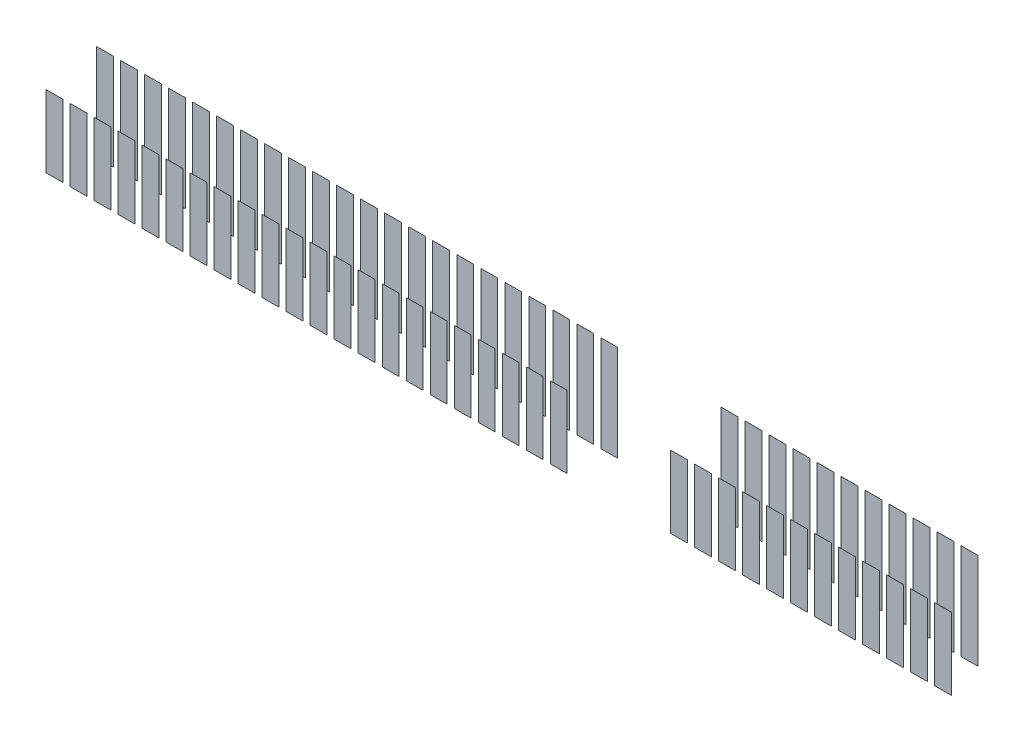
from build123d import *

# Parameters (mm, degrees)
TOP_W                         = 0.35
TOP_H                         = 1.5
BOSS_EXTRUDE1_TOP_DEPTH       = 0.001
BOSS_EXTRUDE1_TOP_2_DEPTH     = 0.001
BOSS_EXTRUDE1_TOP_3_DEPTH     = 0.001
BOSS_EXTRUDE1_TOP_4_DEPTH     = 0.001
BOSS_EXTRUDE1_TOP_5_DEPTH     = 0.001
BOSS_EXTRUDE1_TOP_6_DEPTH     = 0.001
BOSS_EXTRUDE1_TOP_7_DEPTH     = 0.001
BOSS_EXTRUDE1_TOP_8_DEPTH     = 0.001
BOSS_EXTRUDE1_TOP_9_DEPTH     = 0.001
BOSS_EXTRUDE1_TOP_10_DEPTH    = 0.001
BOSS_EXTRUDE1_TOP_11_DEPTH    = 0.001
BOSS_EXTRUDE1_TOP_12_DEPTH    = 0.001
BOSS_EXTRUDE1_TOP_13_DEPTH    = 0.001
BOSS_EXTRUDE1_TOP_14_DEPTH    = 0.001
BOSS_EXTRUDE1_TOP_15_DEPTH    = 0.001
BOSS_EXTRUDE1_TOP_16_DEPTH    = 0.001
BOSS_EXTRUDE1_TOP_17_DEPTH    = 0.001
BOSS_EXTRUDE1_TOP_18_DEPTH    = 0.001
BOSS_EXTRUDE1_TOP_19_DEPTH    = 0.001
BOSS_EXTRUDE1_TOP_20_DEPTH    = 0.001
BOSS_EXTRUDE1_TOP_21_DEPTH    = 0.001
BOSS_EXTRUDE1_TOP_22_DEPTH    = 0.001
BOSS_EXTRUDE1_TOP_23_DEPTH    = 0.001
BOSS_EXTRUDE1_TOP_24_DEPTH    = 0.001
BOSS_EXTRUDE1_TOP_25_DEPTH    = 0.001
BOSS_EXTRUDE1_TOP_26_DEPTH    = 0.001
BOSS_EXTRUDE1_TOP_27_DEPTH    = 0.001
BOSS_EXTRUDE1_TOP_28_DEPTH    = 0.001
BOSS_EXTRUDE1_TOP_29_DEPTH    = 0.001
BOSS_EXTRUDE1_TOP_30_DEPTH    = 0.001
BOSS_EXTRUDE1_TOP_31_DEPTH    = 0.001
BOSS_EXTRUDE1_TOP_32_DEPTH    = 0.001
BOSS_EXTRUDE1_TOP_33_DEPTH    = 0.001
BOSS_EXTRUDE1_TOP_34_DEPTH    = 0.001
BOSS_EXTRUDE2_BOTTOM_START    = -0.8
BOTTOM_W                      = 0.35
BOTTOM_H                      = 2
BOSS_EXTRUDE2_BOTTOM_DEPTH    = 0.001
BOSS_EXTRUDE2_BOTTOM_2_DEPTH  = 0.001
BOSS_EXTRUDE2_BOTTOM_3_DEPTH  = 0.001
BOSS_EXTRUDE2_BOTTOM_4_DEPTH  = 0.001
BOSS_EXTRUDE2_BOTTOM_5_DEPTH  = 0.001
BOSS_EXTRUDE2_BOTTOM_6_DEPTH  = 0.001
BOSS_EXTRUDE2_BOTTOM_7_DEPTH  = 0.001
BOSS_EXTRUDE2_BOTTOM_8_DEPTH  = 0.001
BOSS_EXTRUDE2_BOTTOM_9_DEPTH  = 0.001
BOSS_EXTRUDE2_BOTTOM_10_DEPTH = 0.001
BOSS_EXTRUDE2_BOTTOM_11_DEPTH = 0.001
BOSS_EXTRUDE2_BOTTOM_12_DEPTH = 0.001
BOSS_EXTRUDE2_BOTTOM_13_DEPTH = 0.001
BOSS_EXTRUDE2_BOTTOM_14_DEPTH = 0.001
BOSS_EXTRUDE2_BOTTOM_15_DEPTH = 0.001
BOSS_EXTRUDE2_BOTTOM_16_DEPTH = 0.001
BOSS_EXTRUDE2_BOTTOM_17_DEPTH = 0.001
BOSS_EXTRUDE2_BOTTOM_18_DEPTH = 0.001
BOSS_EXTRUDE2_BOTTOM_19_DEPTH = 0.001
BOSS_EXTRUDE2_BOTTOM_20_DEPTH = 0.001
BOSS_EXTRUDE2_BOTTOM_21_DEPTH = 0.001
BOSS_EXTRUDE2_BOTTOM_22_DEPTH = 0.001
BOSS_EXTRUDE2_BOTTOM_23_DEPTH = 0.001
BOSS_EXTRUDE2_BOTTOM_24_DEPTH = 0.001
BOSS_EXTRUDE2_BOTTOM_25_DEPTH = 0.001
BOSS_EXTRUDE2_BOTTOM_26_DEPTH = 0.001
BOSS_EXTRUDE2_BOTTOM_27_DEPTH = 0.001
BOSS_EXTRUDE2_BOTTOM_28_DEPTH = 0.001
BOSS_EXTRUDE2_BOTTOM_29_DEPTH = 0.001
BOSS_EXTRUDE2_BOTTOM_30_DEPTH = 0.001
BOSS_EXTRUDE2_BOTTOM_31_DEPTH = 0.001
BOSS_EXTRUDE2_BOTTOM_32_DEPTH = 0.001
BOSS_EXTRUDE2_BOTTOM_33_DEPTH = 0.001


with BuildPart() as part:
    # top → Boss-Extrude1-TOP (new body)
    with BuildSketch(Plane.XY):
        with Locations((-9.25, -3.95)):
            Rectangle(TOP_W, TOP_H)
    extrude(amount=BOSS_EXTRUDE1_TOP_DEPTH)


with BuildPart() as body_2:
    # top → Boss-Extrude1-TOP 2 (new body)
    with BuildSketch(Plane.XY):
        with Locations((-8.25, -3.95)):
            Rectangle(TOP_W, TOP_H)
    extrude(amount=BOSS_EXTRUDE1_TOP_2_DEPTH)


with BuildPart() as body_3:
    # top → Boss-Extrude1-TOP 3 (new body)
    with BuildSketch(Plane.XY):
        with Locations((-7.75, -3.95)):
            Rectangle(TOP_W, TOP_H)
    extrude(amount=BOSS_EXTRUDE1_TOP_3_DEPTH)


with BuildPart() as body_4:
    # top → Boss-Extrude1-TOP 4 (new body)
    with BuildSketch(Plane.XY):
        with Locations((-6.75, -3.95)):
            Rectangle(TOP_W, TOP_H)
    extrude(amount=BOSS_EXTRUDE1_TOP_4_DEPTH)


with BuildPart() as body_5:
    # top → Boss-Extrude1-TOP 5 (new body)
    with BuildSketch(Plane.XY):
        with Locations((-5.75, -3.95)):
            Rectangle(TOP_W, TOP_H)
    extrude(amount=BOSS_EXTRUDE1_TOP_5_DEPTH)


with BuildPart() as body_6:
    # top → Boss-Extrude1-TOP 6 (new body)
    with BuildSketch(Plane.XY):
        with Locations((-5.25, -3.95)):
            Rectangle(TOP_W, TOP_H)
    extrude(amount=BOSS_EXTRUDE1_TOP_6_DEPTH)


with BuildPart() as body_7:
    # top → Boss-Extrude1-TOP 7 (new body)
    with BuildSketch(Plane.XY):
        with Locations((-4.75, -3.95)):
            Rectangle(TOP_W, TOP_H)
    extrude(amount=BOSS_EXTRUDE1_TOP_7_DEPTH)


with BuildPart() as body_8:
    # top → Boss-Extrude1-TOP 8 (new body)
    with BuildSketch(Plane.XY):
        with Locations((-4.25, -3.95)):
            Rectangle(TOP_W, TOP_H)
    extrude(amount=BOSS_EXTRUDE1_TOP_8_DEPTH)


with BuildPart() as body_9:
    # top → Boss-Extrude1-TOP 9 (new body)
    with BuildSketch(Plane.XY):
        with Locations((-3.75, -3.95)):
            Rectangle(TOP_W, TOP_H)
    extrude(amount=BOSS_EXTRUDE1_TOP_9_DEPTH)


with BuildPart() as body_10:
    # top → Boss-Extrude1-TOP 10 (new body)
    with BuildSketch(Plane.XY):
        with Locations((-3.25, -3.95)):
            Rectangle(TOP_W, TOP_H)
    extrude(amount=BOSS_EXTRUDE1_TOP_10_DEPTH)


with BuildPart() as body_11:
    # top → Boss-Extrude1-TOP 11 (new body)
    with BuildSketch(Plane.XY):
        with Locations((-2.75, -3.95)):
            Rectangle(TOP_W, TOP_H)
    extrude(amount=BOSS_EXTRUDE1_TOP_11_DEPTH)


with BuildPart() as body_12:
    # top → Boss-Extrude1-TOP 12 (new body)
    with BuildSketch(Plane.XY):
        with Locations((-1.25, -3.95)):
            Rectangle(TOP_W, TOP_H)
    extrude(amount=BOSS_EXTRUDE1_TOP_12_DEPTH)


with BuildPart() as body_13:
    # top → Boss-Extrude1-TOP 13 (new body)
    with BuildSketch(Plane.XY):
        with Locations((-0.75, -3.95)):
            Rectangle(TOP_W, TOP_H)
    extrude(amount=BOSS_EXTRUDE1_TOP_13_DEPTH)


with BuildPart() as body_14:
    # top → Boss-Extrude1-TOP 14 (new body)
    with BuildSketch(Plane.XY):
        with Locations((-0.25, -3.95)):
            Rectangle(TOP_W, TOP_H)
    extrude(amount=BOSS_EXTRUDE1_TOP_14_DEPTH)


with BuildPart() as body_15:
    # top → Boss-Extrude1-TOP 15 (new body)
    with BuildSketch(Plane.XY):
        with Locations((0.25, -3.95)):
            Rectangle(TOP_W, TOP_H)
    extrude(amount=BOSS_EXTRUDE1_TOP_15_DEPTH)


with BuildPart() as body_16:
    # top → Boss-Extrude1-TOP 16 (new body)
    with BuildSketch(Plane.XY):
        with Locations((0.75, -3.95)):
            Rectangle(TOP_W, TOP_H)
    extrude(amount=BOSS_EXTRUDE1_TOP_16_DEPTH)


with BuildPart() as body_17:
    # top → Boss-Extrude1-TOP 17 (new body)
    with BuildSketch(Plane.XY):
        with Locations((3.75, -3.95)):
            Rectangle(TOP_W, TOP_H)
    extrude(amount=BOSS_EXTRUDE1_TOP_17_DEPTH)


with BuildPart() as body_18:
    # top → Boss-Extrude1-TOP 18 (new body)
    with BuildSketch(Plane.XY):
        with Locations((4.25, -3.95)):
            Rectangle(TOP_W, TOP_H)
    extrude(amount=BOSS_EXTRUDE1_TOP_18_DEPTH)


with BuildPart() as body_19:
    # top → Boss-Extrude1-TOP 19 (new body)
    with BuildSketch(Plane.XY):
        with Locations((4.75, -3.95)):
            Rectangle(TOP_W, TOP_H)
    extrude(amount=BOSS_EXTRUDE1_TOP_19_DEPTH)


with BuildPart() as body_20:
    # top → Boss-Extrude1-TOP 20 (new body)
    with BuildSketch(Plane.XY):
        with Locations((5.25, -3.95)):
            Rectangle(TOP_W, TOP_H)
    extrude(amount=BOSS_EXTRUDE1_TOP_20_DEPTH)


with BuildPart() as body_21:
    # top → Boss-Extrude1-TOP 21 (new body)
    with BuildSketch(Plane.XY):
        with Locations((5.75, -3.95)):
            Rectangle(TOP_W, TOP_H)
    extrude(amount=BOSS_EXTRUDE1_TOP_21_DEPTH)


with BuildPart() as body_22:
    # top → Boss-Extrude1-TOP 22 (new body)
    with BuildSketch(Plane.XY):
        with Locations((6.25, -3.95)):
            Rectangle(TOP_W, TOP_H)
    extrude(amount=BOSS_EXTRUDE1_TOP_22_DEPTH)


with BuildPart() as body_23:
    # top → Boss-Extrude1-TOP 23 (new body)
    with BuildSketch(Plane.XY):
        with Locations((6.75, -3.95)):
            Rectangle(TOP_W, TOP_H)
    extrude(amount=BOSS_EXTRUDE1_TOP_23_DEPTH)


with BuildPart() as body_24:
    # top → Boss-Extrude1-TOP 24 (new body)
    with BuildSketch(Plane.XY):
        with Locations((7.25, -3.95)):
            Rectangle(TOP_W, TOP_H)
    extrude(amount=BOSS_EXTRUDE1_TOP_24_DEPTH)


with BuildPart() as body_25:
    # top → Boss-Extrude1-TOP 25 (new body)
    with BuildSketch(Plane.XY):
        with Locations((7.75, -3.95)):
            Rectangle(TOP_W, TOP_H)
    extrude(amount=BOSS_EXTRUDE1_TOP_25_DEPTH)


with BuildPart() as body_26:
    # top → Boss-Extrude1-TOP 26 (new body)
    with BuildSketch(Plane.XY):
        with Locations((8.25, -3.95)):
            Rectangle(TOP_W, TOP_H)
    extrude(amount=BOSS_EXTRUDE1_TOP_26_DEPTH)


with BuildPart() as body_27:
    # top → Boss-Extrude1-TOP 27 (new body)
    with BuildSketch(Plane.XY):
        with Locations((8.75, -3.95)):
            Rectangle(TOP_W, TOP_H)
    extrude(amount=BOSS_EXTRUDE1_TOP_27_DEPTH)


with BuildPart() as body_28:
    # top → Boss-Extrude1-TOP 28 (new body)
    with BuildSketch(Plane.XY):
        with Locations((-8.75, -3.95)):
            Rectangle(TOP_W, TOP_H)
    extrude(amount=BOSS_EXTRUDE1_TOP_28_DEPTH)


with BuildPart() as body_29:
    # top → Boss-Extrude1-TOP 29 (new body)
    with BuildSketch(Plane.XY):
        with Locations((-7.25, -3.95)):
            Rectangle(TOP_W, TOP_H)
    extrude(amount=BOSS_EXTRUDE1_TOP_29_DEPTH)


with BuildPart() as body_30:
    # top → Boss-Extrude1-TOP 30 (new body)
    with BuildSketch(Plane.XY):
        with Locations((-6.25, -3.95)):
            Rectangle(TOP_W, TOP_H)
    extrude(amount=BOSS_EXTRUDE1_TOP_30_DEPTH)


with BuildPart() as body_31:
    # top → Boss-Extrude1-TOP 31 (new body)
    with BuildSketch(Plane.XY):
        with Locations((-2.25, -3.95)):
            Rectangle(TOP_W, TOP_H)
    extrude(amount=BOSS_EXTRUDE1_TOP_31_DEPTH)


with BuildPart() as body_32:
    # top → Boss-Extrude1-TOP 32 (new body)
    with BuildSketch(Plane.XY):
        with Locations((-1.75, -3.95)):
            Rectangle(TOP_W, TOP_H)
    extrude(amount=BOSS_EXTRUDE1_TOP_32_DEPTH)


with BuildPart() as body_33:
    # top → Boss-Extrude1-TOP 33 (new body)
    with BuildSketch(Plane.XY):
        with Locations((1.25, -3.95)):
            Rectangle(TOP_W, TOP_H)
    extrude(amount=BOSS_EXTRUDE1_TOP_33_DEPTH)


with BuildPart() as body_34:
    # top → Boss-Extrude1-TOP 34 (new body)
    with BuildSketch(Plane.XY):
        with Locations((9.25, -3.95)):
            Rectangle(TOP_W, TOP_H)
    extrude(amount=BOSS_EXTRUDE1_TOP_34_DEPTH)


with BuildPart() as body_35:
    # bottom → Boss-Extrude2-BOTTOM (new body)
    with BuildSketch(Plane.XY.offset(BOSS_EXTRUDE2_BOTTOM_START)):
        with Locations((-9, -3.7)):
            Rectangle(BOTTOM_W, BOTTOM_H)
    extrude(amount=-BOSS_EXTRUDE2_BOTTOM_DEPTH)


with BuildPart() as body_36:
    # bottom → Boss-Extrude2-BOTTOM 2 (new body)
    with BuildSketch(Plane.XY.offset(BOSS_EXTRUDE2_BOTTOM_START)):
        with Locations((-8.5, -3.7)):
            Rectangle(BOTTOM_W, BOTTOM_H)
    extrude(amount=-BOSS_EXTRUDE2_BOTTOM_2_DEPTH)


with BuildPart() as body_37:
    # bottom → Boss-Extrude2-BOTTOM 3 (new body)
    with BuildSketch(Plane.XY.offset(BOSS_EXTRUDE2_BOTTOM_START)):
        with Locations((-8, -3.7)):
            Rectangle(BOTTOM_W, BOTTOM_H)
    extrude(amount=-BOSS_EXTRUDE2_BOTTOM_3_DEPTH)


with BuildPart() as body_38:
    # bottom → Boss-Extrude2-BOTTOM 4 (new body)
    with BuildSketch(Plane.XY.offset(BOSS_EXTRUDE2_BOTTOM_START)):
        with Locations((-7.5, -3.7)):
            Rectangle(BOTTOM_W, BOTTOM_H)
    extrude(amount=-BOSS_EXTRUDE2_BOTTOM_4_DEPTH)


with BuildPart() as body_39:
    # bottom → Boss-Extrude2-BOTTOM 5 (new body)
    with BuildSketch(Plane.XY.offset(BOSS_EXTRUDE2_BOTTOM_START)):
        with Locations((-7, -3.7)):
            Rectangle(BOTTOM_W, BOTTOM_H)
    extrude(amount=-BOSS_EXTRUDE2_BOTTOM_5_DEPTH)


with BuildPart() as body_40:
    # bottom → Boss-Extrude2-BOTTOM 6 (new body)
    with BuildSketch(Plane.XY.offset(BOSS_EXTRUDE2_BOTTOM_START)):
        with Locations((-6.5, -3.7)):
            Rectangle(BOTTOM_W, BOTTOM_H)
    extrude(amount=-BOSS_EXTRUDE2_BOTTOM_6_DEPTH)


with BuildPart() as body_41:
    # bottom → Boss-Extrude2-BOTTOM 7 (new body)
    with BuildSketch(Plane.XY.offset(BOSS_EXTRUDE2_BOTTOM_START)):
        with Locations((-6, -3.7)):
            Rectangle(BOTTOM_W, BOTTOM_H)
    extrude(amount=-BOSS_EXTRUDE2_BOTTOM_7_DEPTH)


with BuildPart() as body_42:
    # bottom → Boss-Extrude2-BOTTOM 8 (new body)
    with BuildSketch(Plane.XY.offset(BOSS_EXTRUDE2_BOTTOM_START)):
        with Locations((-5.5, -3.7)):
            Rectangle(BOTTOM_W, BOTTOM_H)
    extrude(amount=-BOSS_EXTRUDE2_BOTTOM_8_DEPTH)


with BuildPart() as body_43:
    # bottom → Boss-Extrude2-BOTTOM 9 (new body)
    with BuildSketch(Plane.XY.offset(BOSS_EXTRUDE2_BOTTOM_START)):
        with Locations((-5, -3.7)):
            Rectangle(BOTTOM_W, BOTTOM_H)
    extrude(amount=-BOSS_EXTRUDE2_BOTTOM_9_DEPTH)


with BuildPart() as body_44:
    # bottom → Boss-Extrude2-BOTTOM 10 (new body)
    with BuildSketch(Plane.XY.offset(BOSS_EXTRUDE2_BOTTOM_START)):
        with Locations((-4.5, -3.7)):
            Rectangle(BOTTOM_W, BOTTOM_H)
    extrude(amount=-BOSS_EXTRUDE2_BOTTOM_10_DEPTH)


with BuildPart() as body_45:
    # bottom → Boss-Extrude2-BOTTOM 11 (new body)
    with BuildSketch(Plane.XY.offset(BOSS_EXTRUDE2_BOTTOM_START)):
        with Locations((-4, -3.7)):
            Rectangle(BOTTOM_W, BOTTOM_H)
    extrude(amount=-BOSS_EXTRUDE2_BOTTOM_11_DEPTH)


with BuildPart() as body_46:
    # bottom → Boss-Extrude2-BOTTOM 12 (new body)
    with BuildSketch(Plane.XY.offset(BOSS_EXTRUDE2_BOTTOM_START)):
        with Locations((-3.5, -3.7)):
            Rectangle(BOTTOM_W, BOTTOM_H)
    extrude(amount=-BOSS_EXTRUDE2_BOTTOM_12_DEPTH)


with BuildPart() as body_47:
    # bottom → Boss-Extrude2-BOTTOM 13 (new body)
    with BuildSketch(Plane.XY.offset(BOSS_EXTRUDE2_BOTTOM_START)):
        with Locations((-3, -3.7)):
            Rectangle(BOTTOM_W, BOTTOM_H)
    extrude(amount=-BOSS_EXTRUDE2_BOTTOM_13_DEPTH)


with BuildPart() as body_48:
    # bottom → Boss-Extrude2-BOTTOM 14 (new body)
    with BuildSketch(Plane.XY.offset(BOSS_EXTRUDE2_BOTTOM_START)):
        with Locations((-2.5, -3.7)):
            Rectangle(BOTTOM_W, BOTTOM_H)
    extrude(amount=-BOSS_EXTRUDE2_BOTTOM_14_DEPTH)


with BuildPart() as body_49:
    # bottom → Boss-Extrude2-BOTTOM 15 (new body)
    with BuildSketch(Plane.XY.offset(BOSS_EXTRUDE2_BOTTOM_START)):
        with Locations((-2, -3.7)):
            Rectangle(BOTTOM_W, BOTTOM_H)
    extrude(amount=-BOSS_EXTRUDE2_BOTTOM_15_DEPTH)


with BuildPart() as body_50:
    # bottom → Boss-Extrude2-BOTTOM 16 (new body)
    with BuildSketch(Plane.XY.offset(BOSS_EXTRUDE2_BOTTOM_START)):
        with Locations((-1.5, -3.7)):
            Rectangle(BOTTOM_W, BOTTOM_H)
    extrude(amount=-BOSS_EXTRUDE2_BOTTOM_16_DEPTH)


with BuildPart() as body_51:
    # bottom → Boss-Extrude2-BOTTOM 17 (new body)
    with BuildSketch(Plane.XY.offset(BOSS_EXTRUDE2_BOTTOM_START)):
        with Locations((-1, -3.7)):
            Rectangle(BOTTOM_W, BOTTOM_H)
    extrude(amount=-BOSS_EXTRUDE2_BOTTOM_17_DEPTH)


with BuildPart() as body_52:
    # bottom → Boss-Extrude2-BOTTOM 18 (new body)
    with BuildSketch(Plane.XY.offset(BOSS_EXTRUDE2_BOTTOM_START)):
        with Locations((-0.5, -3.7)):
            Rectangle(BOTTOM_W, BOTTOM_H)
    extrude(amount=-BOSS_EXTRUDE2_BOTTOM_18_DEPTH)


with BuildPart() as body_53:
    # bottom → Boss-Extrude2-BOTTOM 19 (new body)
    with BuildSketch(Plane.XY.offset(BOSS_EXTRUDE2_BOTTOM_START)):
        with Locations((0, -3.7)):
            Rectangle(BOTTOM_W, BOTTOM_H)
    extrude(amount=-BOSS_EXTRUDE2_BOTTOM_19_DEPTH)


with BuildPart() as body_54:
    # bottom → Boss-Extrude2-BOTTOM 20 (new body)
    with BuildSketch(Plane.XY.offset(BOSS_EXTRUDE2_BOTTOM_START)):
        with Locations((0.5, -3.7)):
            Rectangle(BOTTOM_W, BOTTOM_H)
    extrude(amount=-BOSS_EXTRUDE2_BOTTOM_20_DEPTH)


with BuildPart() as body_55:
    # bottom → Boss-Extrude2-BOTTOM 21 (new body)
    with BuildSketch(Plane.XY.offset(BOSS_EXTRUDE2_BOTTOM_START)):
        with Locations((1, -3.7)):
            Rectangle(BOTTOM_W, BOTTOM_H)
    extrude(amount=-BOSS_EXTRUDE2_BOTTOM_21_DEPTH)


with BuildPart() as body_56:
    # bottom → Boss-Extrude2-BOTTOM 22 (new body)
    with BuildSketch(Plane.XY.offset(BOSS_EXTRUDE2_BOTTOM_START)):
        with Locations((1.5, -3.7)):
            Rectangle(BOTTOM_W, BOTTOM_H)
    extrude(amount=-BOSS_EXTRUDE2_BOTTOM_22_DEPTH)


with BuildPart() as body_57:
    # bottom → Boss-Extrude2-BOTTOM 23 (new body)
    with BuildSketch(Plane.XY.offset(BOSS_EXTRUDE2_BOTTOM_START)):
        with Locations((4, -3.7)):
            Rectangle(BOTTOM_W, BOTTOM_H)
    extrude(amount=-BOSS_EXTRUDE2_BOTTOM_23_DEPTH)


with BuildPart() as body_58:
    # bottom → Boss-Extrude2-BOTTOM 24 (new body)
    with BuildSketch(Plane.XY.offset(BOSS_EXTRUDE2_BOTTOM_START)):
        with Locations((4.5, -3.7)):
            Rectangle(BOTTOM_W, BOTTOM_H)
    extrude(amount=-BOSS_EXTRUDE2_BOTTOM_24_DEPTH)


with BuildPart() as body_59:
    # bottom → Boss-Extrude2-BOTTOM 25 (new body)
    with BuildSketch(Plane.XY.offset(BOSS_EXTRUDE2_BOTTOM_START)):
        with Locations((5, -3.7)):
            Rectangle(BOTTOM_W, BOTTOM_H)
    extrude(amount=-BOSS_EXTRUDE2_BOTTOM_25_DEPTH)


with BuildPart() as body_60:
    # bottom → Boss-Extrude2-BOTTOM 26 (new body)
    with BuildSketch(Plane.XY.offset(BOSS_EXTRUDE2_BOTTOM_START)):
        with Locations((5.5, -3.7)):
            Rectangle(BOTTOM_W, BOTTOM_H)
    extrude(amount=-BOSS_EXTRUDE2_BOTTOM_26_DEPTH)


with BuildPart() as body_61:
    # bottom → Boss-Extrude2-BOTTOM 27 (new body)
    with BuildSketch(Plane.XY.offset(BOSS_EXTRUDE2_BOTTOM_START)):
        with Locations((6, -3.7)):
            Rectangle(BOTTOM_W, BOTTOM_H)
    extrude(amount=-BOSS_EXTRUDE2_BOTTOM_27_DEPTH)


with BuildPart() as body_62:
    # bottom → Boss-Extrude2-BOTTOM 28 (new body)
    with BuildSketch(Plane.XY.offset(BOSS_EXTRUDE2_BOTTOM_START)):
        with Locations((6.5, -3.7)):
            Rectangle(BOTTOM_W, BOTTOM_H)
    extrude(amount=-BOSS_EXTRUDE2_BOTTOM_28_DEPTH)


with BuildPart() as body_63:
    # bottom → Boss-Extrude2-BOTTOM 29 (new body)
    with BuildSketch(Plane.XY.offset(BOSS_EXTRUDE2_BOTTOM_START)):
        with Locations((7, -3.7)):
            Rectangle(BOTTOM_W, BOTTOM_H)
    extrude(amount=-BOSS_EXTRUDE2_BOTTOM_29_DEPTH)


with BuildPart() as body_64:
    # bottom → Boss-Extrude2-BOTTOM 30 (new body)
    with BuildSketch(Plane.XY.offset(BOSS_EXTRUDE2_BOTTOM_START)):
        with Locations((7.5, -3.7)):
            Rectangle(BOTTOM_W, BOTTOM_H)
    extrude(amount=-BOSS_EXTRUDE2_BOTTOM_30_DEPTH)


with BuildPart() as body_65:
    # bottom → Boss-Extrude2-BOTTOM 31 (new body)
    with BuildSketch(Plane.XY.offset(BOSS_EXTRUDE2_BOTTOM_START)):
        with Locations((8, -3.7)):
            Rectangle(BOTTOM_W, BOTTOM_H)
    extrude(amount=-BOSS_EXTRUDE2_BOTTOM_31_DEPTH)


with BuildPart() as body_66:
    # bottom → Boss-Extrude2-BOTTOM 32 (new body)
    with BuildSketch(Plane.XY.offset(BOSS_EXTRUDE2_BOTTOM_START)):
        with Locations((8.5, -3.7)):
            Rectangle(BOTTOM_W, BOTTOM_H)
    extrude(amount=-BOSS_EXTRUDE2_BOTTOM_32_DEPTH)


with BuildPart() as body_67:
    # bottom → Boss-Extrude2-BOTTOM 33 (new body)
    with BuildSketch(Plane.XY.offset(BOSS_EXTRUDE2_BOTTOM_START)):
        with Locations((9, -3.7)):
            Rectangle(BOTTOM_W, BOTTOM_H)
    extrude(amount=-BOSS_EXTRUDE2_BOTTOM_33_DEPTH)


solid = Compound([part.part, body_2.part, body_3.part, body_4.part, body_5.part, body_6.part, body_7.part, body_8.part, body_9.part, body_10.part, body_11.part, body_12.part, body_13.part, body_14.part, body_15.part, body_16.part, body_17.part, body_18.part, body_19.part, body_20.part, body_21.part, body_22.part, body_23.part, body_24.part, body_25.part, body_26.part, body_27.part, body_28.part, body_29.part, body_30.part, body_31.part, body_32.part, body_33.part, body_34.part, body_35.part, body_36.part, body_37.part, body_38.part, body_39.part, body_40.part, body_41.part, body_42.part, body_43.part, body_44.part, body_45.part, body_46.part, body_47.part, body_48.part, body_49.part, body_50.part, body_51.part, body_52.part, body_53.part, body_54.part, body_55.part, body_56.part, body_57.part, body_58.part, body_59.part, body_60.part, body_61.part, body_62.part, body_63.part, body_64.part, body_65.part, body_66.part, body_67.part])
